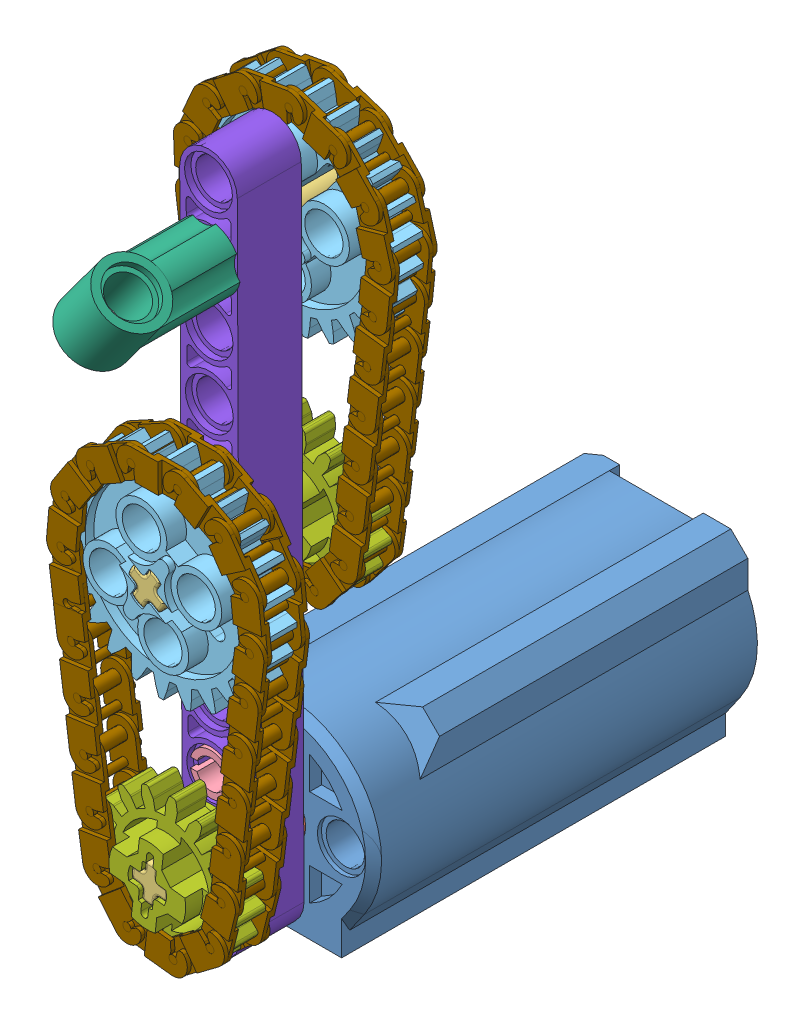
SolidWorks assembly 146.SLDASM, configuration 기본 (file format 9000). Lengths in mm.
Overall size (36.5 94.25 72.3).
57 component instances, 9 part files, 33 mates.
Components (placement in the parent):
- 9V Motor M-1: 9V Motor M.SLDPRT [기본] at (26.3847 -3.5129 48.1336) size (24 24 48.27)
- Motor 9V  PF Medium part-1: Motor 9V  PF Medium part.SLDPRT [기본] at (27.1465 -1.5951 64.1336) x (0.11254 0.993647 0) z (0 0 1) size (7 7 8)
- 4519 Axle 3-1: 4519 Axle 3.SLDPRT [기본] at (26.3847 -3.5129 88.1336) x (0.11254 0.993647 0) z (-0.993647 0.11254 0) size (4.8 24.01 4.8)
- 2780 Pin with Friction Ridges Lengthwise WITH Center Slots-1: 2780 Pin with Friction Ridges Lengthwise WITH Center Slots.SLDPRT [기본] at (26.3147 4.4871 72.4336) x (1 0 0) z (0 -1 0) size (6 16 5.88)
- 3648 Gear 24-1: 3648 Gear 24.SLDPRT [기본] at (26.0697 60.4864 68.4336) x (0.593513 0.804825 0) z (0.804825 -0.593513 0) size (26.1 8 26.1)
- 3648 Gear 24-2: 3648 Gear 24.SLDPRT [기본] at (26.2097 28.4867 84.4336) x (-0.856635 0.515923 0) z (-0.515923 -0.856635 0) size (26.1 8 26.1)
- 32013 Axle pin connector angled #1-1: 32013 Axle pin connector angled #1.SLDPRT [기본] at (26.0697 60.4864 80.4336) x (0 0 -1) z (0.593513 0.804825 0) size (16 8 8)
- 94925 Gear 16 old-1: 94925 Gear 16 old.SLDPRT [기본] at (26.2097 28.4867 68.4336) x (-0.856635 0.515923 0) z (0.515923 0.856635 0) size (18 8 18)
- 94925 Gear 16 old-2: 94925 Gear 16 old.SLDPRT [기본] at (26.3847 -3.5129 84.4336) x (0.993647 -0.11254 0) z (0.11254 0.993647 0) size (18 8 18)
- 32525 Beam 11-1: 32525 Beam 11.SLDPRT [기본] at (26.3847 -11.5129 80.4336) x (-0.004375 0.99999 0) z (-0.99999 -0.004375 0) size (87.2 8 7.2)
- 4519 Axle 3-2: 4519 Axle 3.SLDPRT [기본] at (26.0697 60.4864 64.4336) x (0.593513 0.804825 0) z (0.804825 -0.593513 0) size (4.8 24.01 4.8)
- 4519 Axle 3-3: 4519 Axle 3.SLDPRT [기본] at (26.2097 28.4867 64.4336) x (-0.856635 0.515923 0) z (0.515923 0.856635 0) size (4.8 24.01 4.8)
- 2780 Pin with Friction Ridges Lengthwise WITH Center Slots-2: 2780 Pin with Friction Ridges Lengthwise WITH Center Slots.SLDPRT [기본] at (26.3847 -11.5129 72.4336) x (1 0 0) z (0 1 0) size (6 16 5.88)
- 3711 Link Chain-1: 3711 Link Chain.SLDPRT [기본] at (15.3382 19.8773 84.4336) x (-0.132929 0.991126 0) z (0 0 1) size (9.4 3.6 5.71)
- 3711 Link Chain-2: 3711 Link Chain.SLDPRT [기본] at (16.1106 14.129 84.4336) x (-0.132929 0.991126 0) z (0 0 1) size (9.4 3.6 5.71)
- 3711 Link Chain-3: 3711 Link Chain.SLDPRT [기본] at (16.8831 8.3806 84.4336) x (-0.132929 0.991126 0) z (0 0 1) size (9.4 3.6 5.71)
- 3711 Link Chain-4: 3711 Link Chain.SLDPRT [기본] at (17.6556 2.6323 84.4336) x (-0.132929 0.991126 0) z (0 0 1) size (9.4 3.6 5.71)
- 3711 Link Chain-5: 3711 Link Chain.SLDPRT [기본] at (18.4947 -3.1063 84.4336) x (-0.155882 0.987776 0) z (0 0 1) size (9.4 3.6 5.71)
- 3711 Link Chain-6: 3711 Link Chain.SLDPRT [기본] at (20.8125 -8.192 84.4336) x (-0.642869 0.765976 0) z (0 0 1) size (9.4 3.6 5.71)
- 3711 Link Chain-7: 3711 Link Chain.SLDPRT [기본] at (25.5592 -10.7421 84.4336) x (-0.993514 0.113707 0) z (0 0 1) size (9.4 3.6 5.71)
- 3711 Link Chain-8: 3711 Link Chain.SLDPRT [기본] at (30.7586 -9.3276 84.4336) x (-0.799309 -0.600921 0) z (0 0 1) size (9.4 3.6 5.71)
- 3711 Link Chain-9: 3711 Link Chain.SLDPRT [기본] at (33.7727 -4.7688 84.4336) x (-0.240354 -0.970685 0) z (0 0 1) size (9.4 3.6 5.71)
- 3711 Link Chain-10: 3711 Link Chain.SLDPRT [기본] at (34.8238 0.9247 84.4336) x (-0.122598 -0.992456 0) z (0 0 1) size (9.4 3.6 5.71)
- 3711 Link Chain-11: 3711 Link Chain.SLDPRT [기본] at (35.5333 6.6811 84.4336) x (-0.122598 -0.992456 0) z (0 0 1) size (9.4 3.6 5.71)
- 3711 Link Chain-12: 3711 Link Chain.SLDPRT [기본] at (36.2429 12.4376 84.4336) x (-0.122598 -0.992456 0) z (0 0 1) size (9.4 3.6 5.71)
- 3711 Link Chain-13: 3711 Link Chain.SLDPRT [기본] at (36.9525 18.194 84.4336) x (-0.122598 -0.992456 0) z (0 0 1) size (9.4 3.6 5.71)
- 3711 Link Chain-14: 3711 Link Chain.SLDPRT [기본] at (37.6621 23.9504 84.4336) x (-0.122598 -0.992456 0) z (0 0 1) size (9.4 3.6 5.71)
- 3711 Link Chain-15: 3711 Link Chain.SLDPRT [기본] at (37.7086 29.7124 84.4336) x (0.106031 -0.994363 0) z (0 0 1) size (9.4 3.6 5.71)
- 3711 Link Chain-16: 3711 Link Chain.SLDPRT [기본] at (35.7683 34.9936 84.4336) x (0.562507 -0.826793 0) z (0 0 1) size (9.4 3.6 5.71)
- 3711 Link Chain-17: 3711 Link Chain.SLDPRT [기본] at (31.5661 38.7345 84.4336) x (0.886118 -0.46346 0) z (0 0 1) size (9.4 3.6 5.71)
- 3711 Link Chain-18: 3711 Link Chain.SLDPRT [기본] at (26.0958 40.0493 84.4336) x (0.999954 0.00959 0) z (0 0 1) size (9.4 3.6 5.71)
- 3711 Link Chain-19: 3711 Link Chain.SLDPRT [기본] at (20.6524 38.627 84.4336) x (0.877066 0.480369 0) z (0 0 1) size (9.4 3.6 5.71)
- 3711 Link Chain-20: 3711 Link Chain.SLDPRT [기본] at (16.5247 34.804 84.4336) x (0.546546 0.837429 0) z (0 0 1) size (9.4 3.6 5.71)
- 3711 Link Chain-21: 3711 Link Chain.SLDPRT [기본] at (14.6877 29.4857 84.4336) x (0.087331 0.996179 0) z (0 0 1) size (9.4 3.6 5.71)
- 3711 Link Chain-22: 3711 Link Chain.SLDPRT [기본] at (14.8214 23.7224 84.4336) x (-0.132929 0.991126 0) z (0 0 1) size (9.4 3.6 5.71)
- 3711 Link Chain-23: 3711 Link Chain.SLDPRT [기본] at (17.9964 30.8216 68.4336) x (0.132362 -0.991201 0) z (0 0 -1) size (9.4 3.6 5.71)
- 3711 Link Chain-24: 3711 Link Chain.SLDPRT [기본] at (17.2302 36.5708 68.4336) x (0.132362 -0.991201 0) z (0 0 -1) size (9.4 3.6 5.71)
- 3711 Link Chain-25: 3711 Link Chain.SLDPRT [기본] at (16.464 42.32 68.4336) x (0.132362 -0.991201 0) z (0 0 -1) size (9.4 3.6 5.71)
- 3711 Link Chain-26: 3711 Link Chain.SLDPRT [기본] at (15.6978 48.0691 68.4336) x (0.132362 -0.991201 0) z (0 0 -1) size (9.4 3.6 5.71)
- 3711 Link Chain-27: 3711 Link Chain.SLDPRT [기본] at (14.9316 53.8183 68.4336) x (0.132362 -0.991201 0) z (0 0 -1) size (9.4 3.6 5.71)
- 3711 Link Chain-28: 3711 Link Chain.SLDPRT [기본] at (14.4331 59.5907 68.4336) x (0.040061 -0.999197 0) z (0 0 -1) size (9.4 3.6 5.71)
- 3711 Link Chain-29: 3711 Link Chain.SLDPRT [기본] at (15.4856 65.1431 68.4336) x (-0.402482 -0.915428 0) z (0 0 -1) size (9.4 3.6 5.71)
- 3711 Link Chain-30: 3711 Link Chain.SLDPRT [기본] at (18.9361 69.5869 68.4336) x (-0.786865 -0.617126 0) z (0 0 -1) size (9.4 3.6 5.71)
- 3711 Link Chain-31: 3711 Link Chain.SLDPRT [기본] at (24.0753 71.8763 68.4336) x (-0.98497 -0.172728 0) z (0 0 -1) size (9.4 3.6 5.71)
- 3711 Link Chain-32: 3711 Link Chain.SLDPRT [기본] at (29.6867 71.4693 68.4336) x (-0.949898 0.31256 0) z (0 0 -1) size (9.4 3.6 5.71)
- 3711 Link Chain-33: 3711 Link Chain.SLDPRT [기본] at (34.4418 68.4623 68.4336) x (-0.689953 0.723855 0) z (0 0 -1) size (9.4 3.6 5.71)
- 3711 Link Chain-34: 3711 Link Chain.SLDPRT [기본] at (37.2149 63.5671 68.4336) x (-0.266671 0.963788 0) z (0 0 -1) size (9.4 3.6 5.71)
- 3711 Link Chain-35: 3711 Link Chain.SLDPRT [기본] at (37.6941 57.8865 68.4336) x (0.100937 0.994893 0) z (0 0 -1) size (9.4 3.6 5.71)
- 3711 Link Chain-36: 3711 Link Chain.SLDPRT [기본] at (37.0427 52.1235 68.4336) x (0.123167 0.992386 0) z (0 0 -1) size (9.4 3.6 5.71)
- 3711 Link Chain-37: 3711 Link Chain.SLDPRT [기본] at (36.3268 46.3679 68.4336) x (0.123167 0.992386 0) z (0 0 -1) size (9.4 3.6 5.71)
- 3711 Link Chain-38: 3711 Link Chain.SLDPRT [기본] at (35.611 40.6122 68.4336) x (0.123167 0.992386 0) z (0 0 -1) size (9.4 3.6 5.71)
- 3711 Link Chain-39: 3711 Link Chain.SLDPRT [기본] at (34.8951 34.8566 68.4336) x (0.123167 0.992386 0) z (0 0 -1) size (9.4 3.6 5.71)
- 3711 Link Chain-40: 3711 Link Chain.SLDPRT [기본] at (34.1249 29.1082 68.4336) x (0.141901 0.989881 0) z (0 0 -1) size (9.4 3.6 5.71)
- 3711 Link Chain-41: 3711 Link Chain.SLDPRT [기본] at (31.9104 23.9652 68.4336) x (0.621213 0.783642 0) z (0 0 -1) size (9.4 3.6 5.71)
- 3711 Link Chain-42: 3711 Link Chain.SLDPRT [기본] at (27.2368 21.2834 68.4336) x (0.989949 0.141424 0) z (0 0 -1) size (9.4 3.6 5.71)
- 3711 Link Chain-43: 3711 Link Chain.SLDPRT [기본] at (22 22.552 68.4336) x (0.815788 -0.578351 0) z (0 0 -1) size (9.4 3.6 5.71)
- 3711 Link Chain-44: 3711 Link Chain.SLDPRT [기본] at (18.8814 27.0308 68.4336) x (0.259893 -0.965637 0) z (0 0 -1) size (9.4 3.6 5.71)
Mates (geometry in assembly coordinates):
- 동심1: concentric: cylinder of 9V Motor M-1 through (26.3847 -3.5129 72.1336) axis (0 0 1) radius 3.505; cylinder of Motor 9V  PF Medium part-1 through (26.3847 -3.5129 72.1336) axis (0 0 -1) radius 3.5
- 일치1: coincident: plane of 9V Motor M-1 through (26.3847 -3.5129 72.1336) normal (0 0 1); plane of Motor 9V  PF Medium part-1 through (26.3847 -3.5129 72.1336) normal (0 0 1)
- 동심2: concentric: cylinder of Motor 9V  PF Medium part-1 through (26.3847 -3.5129 72.1336) axis (0 0 -1) radius 2.4; cylinder of 4519 Axle 3-1 through (26.3847 -3.5129 64.1336) axis (0 0 1) radius 2.4
- 일치2: coincident: plane of Motor 9V  PF Medium part-1 through (27.7428 -2.7591 72.1336) normal (-0.895232 0.4456 0); plane of 4519 Axle 3-1 through (27.5646 -3.1172 64.1336) normal (0.895232 -0.4456 0)
- 일치3: coincident: circle of Motor 9V  PF Medium part-1; plane of 4519 Axle 3-1 through (26.3847 -3.5129 64.1336) normal (0 0 -1)
- 동심3: concentric: cylinder of 9V Motor M-1 through (26.3147 4.4871 72.1336) axis (0 0 1) radius 2.4; cylinder of 2780 Pin with Friction Ridges Lengthwise WITH Center Slots-1 through (26.3147 4.4871 64.4336) axis (0 0 1) radius 2.4
- 일치4: coincident: plane of 9V Motor M-1 through (28.7147 4.4871 71.6336) normal (0 0 1); plane of 2780 Pin with Friction Ridges Lengthwise WITH Center Slots-1 through (26.3147 4.4871 71.6336) normal (0 0 -1)
- 동심4: concentric: cylinder of 9V Motor M-1 through (26.3847 -11.5129 72.1336) axis (0 0 1) radius 2.4; cylinder of 2780 Pin with Friction Ridges Lengthwise WITH Center Slots-2 through (26.3847 -11.5129 80.4336) axis (0 0 -1) radius 2.4
- 일치5: coincident: plane of 9V Motor M-1 through (28.7847 -11.5129 71.6336) normal (0 0 1); plane of 2780 Pin with Friction Ridges Lengthwise WITH Center Slots-2 through (26.3847 -11.5129 71.6336) normal (0 0 -1)
- 동심5: concentric: cylinder of 32525 Beam 11-1 through (26.3847 -11.5127 72.4336) axis (0 0 1) radius 2.4; cylinder of 2780 Pin with Friction Ridges Lengthwise WITH Center Slots-2 through (26.3847 -11.5129 80.4336) axis (0 0 -1) radius 2.4
- 동심6: concentric: cylinder of 2780 Pin with Friction Ridges Lengthwise WITH Center Slots-1 through (26.3147 4.4871 64.4336) axis (0 0 1) radius 2.4; cylinder of 32525 Beam 11-1 through (26.3147 4.4871 72.4336) axis (0 0 1) radius 2.4
- 일치6: coincident: plane of 2780 Pin with Friction Ridges Lengthwise WITH Center Slots-1 through (26.3147 4.4871 73.2336) normal (0 0 1); plane of 32525 Beam 11-1 through (26.3147 4.4871 73.2336) normal (0 0 -1)
- 동심7: concentric: cylinder of 4519 Axle 3-1 through (26.3847 -3.5129 64.1336) axis (0 0 1) radius 2.4; cylinder of 94925 Gear 16 old-2 through (26.3847 -3.5129 88.4336) axis (0 0 -1) radius 2.4
- 일치7: coincident: plane of 4519 Axle 3-1 through (25.2047 -3.9086 64.1336) normal (-0.895232 0.4456 0); plane of 94925 Gear 16 old-2 through (24.6019 -5.1197 88.4336) normal (0.895232 -0.4456 0)
- 일치8: coincident: plane of 94925 Gear 16 old-2 through (26.3847 -3.5129 80.4336) normal (0 0 -1); plane of 32525 Beam 11-1 through (26.3847 -11.5127 80.4336) normal (0 0 1)
- 동심8: concentric: cylinder of 32525 Beam 11-1 through (26.2097 28.4869 72.4336) axis (0 0 1) radius 2.4; cylinder of 4519 Axle 3-3 through (26.2097 28.4869 88.4336) axis (0 0 -1) radius 2.4
- 동심9: concentric: cylinder of 3648 Gear 24-2 through (26.2097 28.4869 80.4336) axis (0 0 1) radius 2.4; cylinder of 4519 Axle 3-3 through (26.2097 28.4869 88.4336) axis (0 0 -1) radius 2.4
- 일치9: coincident: plane of 3648 Gear 24-2 through (19.5007 27.5264 82.5786) normal (0.269046 -0.963127 0); plane of 4519 Axle 3-3 through (26.8205 29.5712 88.4336) normal (-0.269046 0.963127 0)
- 일치10: coincident: plane of 3648 Gear 24-2 through (28.9453 33.4234 80.4336) normal (0 0 -1); plane of 32525 Beam 11-1 through (26.3847 -11.5127 80.4336) normal (0 0 1)
- 일치11: coincident: plane of 3648 Gear 24-2 through (28.9453 33.4234 88.4336) normal (0 0 1); plane of 4519 Axle 3-3 through (26.2097 28.4869 88.4336) normal (0 0 1)
- 동심10: concentric: cylinder of 94925 Gear 16 old-1 through (26.2097 28.4869 64.4336) axis (0 0 1) radius 2.4; cylinder of 4519 Axle 3-3 through (26.2097 28.4869 88.4336) axis (0 0 -1) radius 2.4
- 일치13: coincident: plane of 94925 Gear 16 old-1 through (25.2136 27.2949 64.4336) normal (-0.269046 0.963127 0); plane of 4519 Axle 3-3 through (25.5989 27.4026 88.4336) normal (0.269046 -0.963127 0)
- 일치14: coincident: plane of 94925 Gear 16 old-1 through (26.2097 28.4869 72.4336) normal (0 0 1); plane of 32525 Beam 11-1 through (26.3847 -11.5127 72.4336) normal (0 0 -1)
- 동심11: concentric: cylinder of 32525 Beam 11-1 through (26.0697 60.4866 72.4336) axis (0 0 1) radius 2.4; cylinder of 4519 Axle 3-2 through (26.0697 60.4866 88.4336) axis (0 0 -1) radius 2.4
- 동심12: concentric: cylinder of 3648 Gear 24-1 through (26.0697 60.4866 64.4336) axis (0 0 1) radius 2.4; cylinder of 4519 Axle 3-2 through (26.0697 60.4866 88.4336) axis (0 0 -1) radius 2.4
- 일치15: coincident: plane of 3648 Gear 24-1 through (25.8136 67.2591 70.2886) normal (0.995732 -0.092294 0); plane of 4519 Axle 3-2 through (25.2746 61.444 88.4336) normal (-0.995732 0.092294 0)
- 일치16: coincident: plane of 3648 Gear 24-1 through (22.471 64.8001 72.4336) normal (0 0 1); plane of 32525 Beam 11-1 through (26.3847 -11.5127 72.4336) normal (0 0 -1)
- 일치17: coincident: plane of 3648 Gear 24-1 through (22.471 64.8001 64.4336) normal (0 0 -1); plane of 4519 Axle 3-2 through (26.0697 60.4866 64.4336) normal (0 0 -1)
- 동심13: concentric: cylinder of 32013 Axle pin connector angled #1-1 through (26.0697 60.4866 96.4346) axis (0 0 -1) radius 2.4; cylinder of 4519 Axle 3-2 through (26.0697 60.4866 88.4336) axis (0 0 -1) radius 2.4
- 일치18: coincident: plane of 32013 Axle pin connector angled #1-1 through (25.3995 62.7911 96.4346) normal (0.995732 -0.092294 0); plane of 4519 Axle 3-2 through (25.2746 61.444 88.4336) normal (-0.995732 0.092294 0)
- 일치19: coincident: plane of 32013 Axle pin connector angled #1-1 through (23.8936 58.6797 80.4336) normal (0 0 -1); plane of 32525 Beam 11-1 through (26.3847 -11.5127 80.4336) normal (0 0 1)
- 기어 메이트1: gear = 24 mm: cylinder of 94925 Gear 16 old-2 through (26.3847 -3.5129 86.2886) axis (0 0 -1) radius 6.5; cylinder of 3648 Gear 24-2 through (26.2097 28.4869 82.5786) axis (0 0 1) radius 10.75
- 기어 메이트2: gear = 24 mm: cylinder of 94925 Gear 16 old-1 through (26.2097 28.4869 66.5786) axis (0 0 1) radius 6.5; cylinder of 3648 Gear 24-1 through (26.0697 60.4866 70.2886) axis (0 0 -1) radius 10.75
